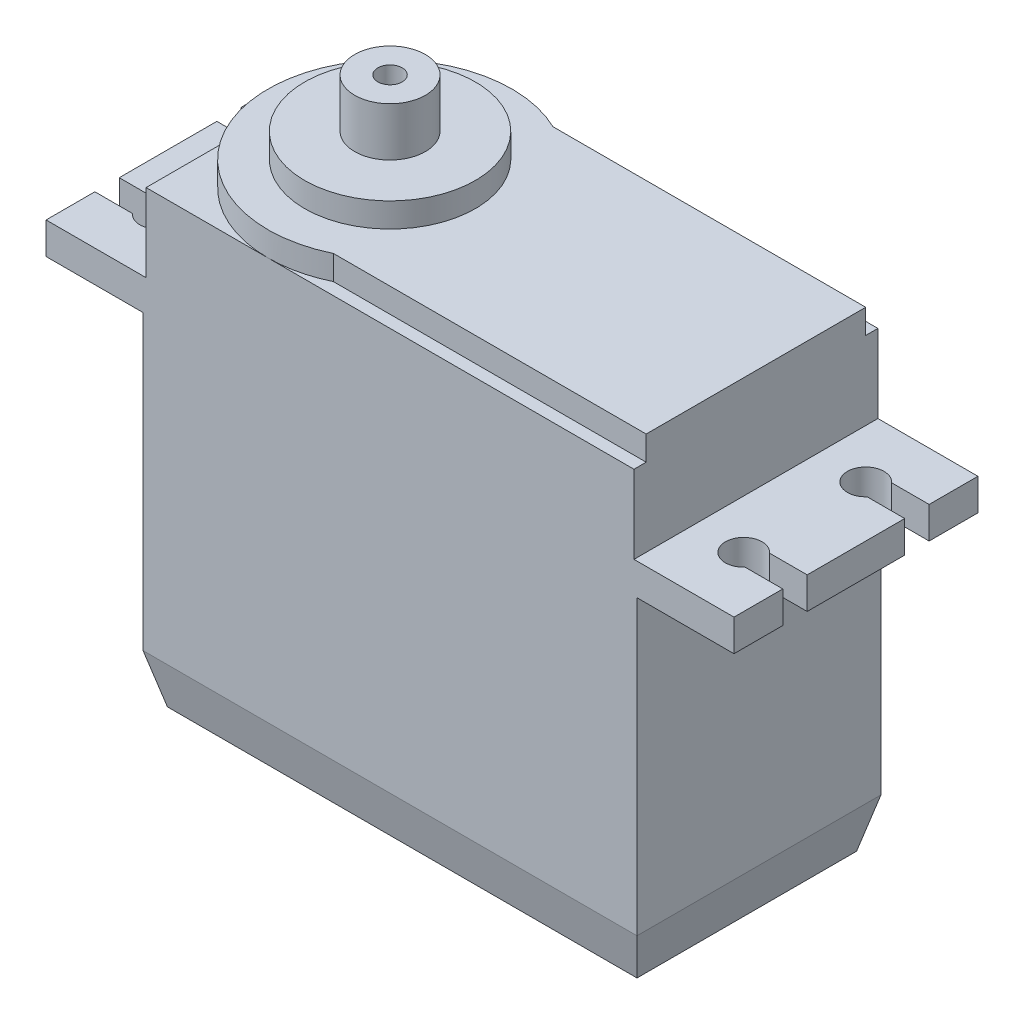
from build123d import *

# Parameters (mm, degrees)
SKETCH_1_W          = 40.5
SKETCH_1_H          = 28
EXTRUDE_10_DEPTH    = 20
SKETCH_18_W         = 40
SKETCH_18_H         = 20
EXTRUDE_11_DEPTH    = 9
SKETCH_19_W         = 20
SKETCH_19_H         = 2.6
EXTRUDE_12_DEPTH    = 8.2
CUT_EXTRUDE_6_DEPTH = 8.2
EXTRUDE_13_DEPTH    = 2
SKETCH_22_R         = 7
EXTRUDE_14_DEPTH    = 2
SKETCH_23_R         = 2.9
EXTRUDE_15_DEPTH    = 4
SKETCH_24_R         = 1
CUT_EXTRUDE_7_DEPTH = 4
CHAMFER_1_SIZE      = 1
CHAMFER_1_SIZE2     = 4


with BuildPart() as part:
    # Sketch 1 → Extrude 10 (new body)
    with BuildSketch(Plane.XY):
        Rectangle(SKETCH_1_W, SKETCH_1_H)
    extrude(amount=EXTRUDE_10_DEPTH)

    # Sketch 18 → Extrude 11 (add)
    with BuildSketch(Plane(origin=(0, 14, 0), x_dir=(1, 0, 0), z_dir=(0, 1, 0))):
        with Locations((0, -10)):
            Rectangle(SKETCH_18_W, SKETCH_18_H)
    extrude(amount=EXTRUDE_11_DEPTH)

    # Sketch 19 → Extrude 12 (add)
    with BuildSketch(Plane(origin=(20, 0, 0), x_dir=(0, 0, -1), z_dir=(1, 0, 0))):
        with Locations((-10, 15.3)):
            Rectangle(SKETCH_19_W, SKETCH_19_H)
    extrude_12 = extrude(amount=EXTRUDE_12_DEPTH)

    # Sketch 20 → Cut-Extrude 6 (cut)
    with BuildSketch(Plane(origin=(0, 16.6, 0), x_dir=(1, 0, 0), z_dir=(0, 1, 0))):
        with BuildLine():
            Line((28.2, -16), (25.118033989, -16))
            ThreePointArc((25.118033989, -16), (22.5, -15), (25.118033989, -14))
            Line((25.118033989, -14), (28.2, -14))
            Line((28.2, -14), (28.2, -16))
        make_face()
        with BuildLine():
            Line((28.2, -4), (28.2, -6))
            Line((28.2, -6), (25.118033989, -6))
            ThreePointArc((25.118033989, -6), (22.5, -5), (25.118033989, -4))
            Line((25.118033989, -4), (28.2, -4))
        make_face()
    cut_extrude_6 = extrude(amount=-CUT_EXTRUDE_6_DEPTH, mode=Mode.SUBTRACT)

    # Mirror 6: Extrude 12 across plane
    add(extrude_12.mirror(Plane(origin=(0, 0, 0), x_dir=(0, 0, 1), z_dir=(1, 0, 0))))

    # Mirror 7: Cut-Extrude 6 across plane
    add(cut_extrude_6.mirror(Plane(origin=(0, 0, 0), x_dir=(0, 0, 1), z_dir=(1, 0, 0))), mode=Mode.SUBTRACT)

    # Sketch 21 → Extrude 13 (add)
    with BuildSketch(Plane(origin=(0, 23, 0), x_dir=(1, 0, 0), z_dir=(0, 1, 0))):
        with BuildLine():
            Line((20, -19), (-5.641101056, -19))
            ThreePointArc((-5.641101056, -19), (-20, -10), (-5.641101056, -1))
            Line((-5.641101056, -1), (20, -1))
            Line((20, -1), (20, -19))
        make_face()
    extrude(amount=EXTRUDE_13_DEPTH)

    # Sketch 22 → Extrude 14 (add)
    with BuildSketch(Plane(origin=(0, 25, 0), x_dir=(1, 0, 0), z_dir=(0, 1, 0))):
        with Locations(Location((-10, -10, 0), (0, 0, 270))):
            Circle(SKETCH_22_R)
    extrude(amount=EXTRUDE_14_DEPTH)

    # Sketch 23 → Extrude 15 (add)
    with BuildSketch(Plane(origin=(0, 27, 0), x_dir=(1, 0, 0), z_dir=(0, 1, 0))):
        with Locations(Location((-10, -10, 0), (0, 0, 270))):
            Circle(SKETCH_23_R)
    extrude(amount=EXTRUDE_15_DEPTH)

    # Sketch 24 → Cut-Extrude 7 (cut)
    with BuildSketch(Plane(origin=(0, 31, 0), x_dir=(1, 0, 0), z_dir=(0, 1, 0))):
        with Locations(Location((-10, -10, 0), (0, 0, 270))):
            Circle(SKETCH_24_R)
    extrude(amount=-CUT_EXTRUDE_7_DEPTH, mode=Mode.SUBTRACT)

    # Chamfer 1
    chamfer_1_edges = [part.edges().sort_by_distance(p)[0] for p in [
        (0, -14, 20),
        (0, -14, 0),
        (20.25, -14, 10),
        (-20.25, -14, 10),
    ]]
    chamfer_1_side = [part.faces().sort_by_distance(p)[0] for p in [
        (0, -14, 10),
    ]]
    chamfer(chamfer_1_edges, length=CHAMFER_1_SIZE, length2=CHAMFER_1_SIZE2, reference=chamfer_1_side[0])


solid = part.part
